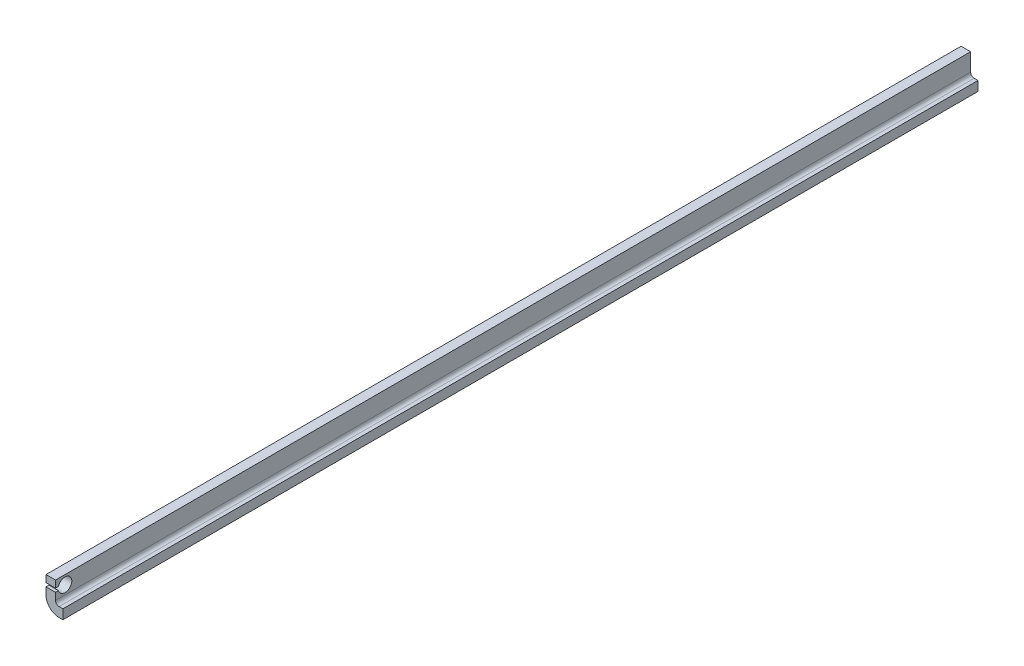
ISO-10303-21;
HEADER;
FILE_DESCRIPTION(('STEP AP214'),'2;1');
FILE_NAME('part.step','',(''),(''),'','','');
FILE_SCHEMA(('AUTOMOTIVE_DESIGN { 1 0 10303 214 1 1 1 1 }'));
ENDSEC;
DATA;
#1=APPLICATION_CONTEXT('core data for automotive mechanical design processes');
#2=APPLICATION_PROTOCOL_DEFINITION('international standard','automotive_design',2000,#1);
#3=PRODUCT_CONTEXT('',#1,'mechanical');
#4=PRODUCT('Part','Part','',(#3));
#5=PRODUCT_RELATED_PRODUCT_CATEGORY('part','',(#4));
#6=PRODUCT_DEFINITION_FORMATION('','',#4);
#7=PRODUCT_DEFINITION_CONTEXT('part definition',#1,'design');
#8=PRODUCT_DEFINITION('design','',#6,#7);
#9=PRODUCT_DEFINITION_SHAPE('','',#8);
#10=(LENGTH_UNIT() NAMED_UNIT(*) SI_UNIT(.MILLI.,.METRE.));
#11=(NAMED_UNIT(*) PLANE_ANGLE_UNIT() SI_UNIT($,.RADIAN.));
#12=(NAMED_UNIT(*) SI_UNIT($,.STERADIAN.) SOLID_ANGLE_UNIT());
#13=UNCERTAINTY_MEASURE_WITH_UNIT(LENGTH_MEASURE(1.E-05),#10,'distance_accuracy_value','');
#14=(GEOMETRIC_REPRESENTATION_CONTEXT(3) GLOBAL_UNCERTAINTY_ASSIGNED_CONTEXT((#13)) GLOBAL_UNIT_ASSIGNED_CONTEXT((#10,
#11,#12)) REPRESENTATION_CONTEXT('',''));
#15=CARTESIAN_POINT('',(0.,0.,0.));
#16=DIRECTION('',(0.,0.,1.));
#17=DIRECTION('',(1.,0.,0.));
#18=AXIS2_PLACEMENT_3D('',#15,#16,#17);
#19=CARTESIAN_POINT('',(11.8291924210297,-3.25477846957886,101.12425));
#20=DIRECTION('',(0.,0.,1.));
#21=DIRECTION('',(1.,0.,0.));
#22=AXIS2_PLACEMENT_3D('',#19,#20,#21);
#23=PLANE('',#22);
#24=DIRECTION('',(-1.,0.,0.));
#25=VECTOR('',#24,1.);
#26=CARTESIAN_POINT('',(11.8291924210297,-5.89787296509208,101.12425));
#27=LINE('',#26,#25);
#28=CARTESIAN_POINT('',(-1.08834656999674,-5.89787296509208,101.12425));
#29=VERTEX_POINT('',#28);
#30=CARTESIAN_POINT('',(-2.14166858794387,-5.89787296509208,101.12425));
#31=VERTEX_POINT('',#30);
#32=EDGE_CURVE('E11',#29,#31,#27,.T.);
#33=ORIENTED_EDGE('',*,*,#32,.F.);
#34=DIRECTION('',(0.,1.,0.));
#35=VECTOR('',#34,1.);
#36=CARTESIAN_POINT('',(-1.08834656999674,-7.07415346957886,101.12425));
#37=LINE('',#36,#35);
#38=CARTESIAN_POINT('',(-1.08834656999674,-5.12159246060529,101.12425));
#39=VERTEX_POINT('',#38);
#40=EDGE_CURVE('E200',#29,#39,#37,.T.);
#41=ORIENTED_EDGE('',*,*,#40,.T.);
#42=DIRECTION('',(-1.,0.,0.));
#43=VECTOR('',#42,1.);
#44=CARTESIAN_POINT('',(-1.08834656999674,-5.12159246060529,101.12425));
#45=LINE('',#44,#43);
#46=CARTESIAN_POINT('',(-2.14166858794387,-5.12159246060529,101.12425));
#47=VERTEX_POINT('',#46);
#48=EDGE_CURVE('E194',#39,#47,#45,.T.);
#49=ORIENTED_EDGE('',*,*,#48,.T.);
#50=DIRECTION('',(0.,-1.,0.));
#51=VECTOR('',#50,1.);
#52=CARTESIAN_POINT('',(-2.14166858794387,-5.12159246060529,101.12425));
#53=LINE('',#52,#51);
#54=EDGE_CURVE('E191',#47,#31,#53,.T.);
#55=ORIENTED_EDGE('',*,*,#54,.T.);
#56=EDGE_LOOP('',(#33,#41,#49,#55));
#57=FACE_BOUND('',#56,.T.);
#58=ADVANCED_FACE('F29',(#57),#23,.T.);
#59=CARTESIAN_POINT('',(-1.08834656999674,-7.07415346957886,105.000050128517));
#60=DIRECTION('',(-1.,0.,0.));
#61=DIRECTION('',(0.,-1.,0.));
#62=AXIS2_PLACEMENT_3D('',#59,#60,#61);
#63=PLANE('',#62);
#64=ORIENTED_EDGE('',*,*,#40,.F.);
#65=DIRECTION('',(0.,0.,-1.));
#66=VECTOR('',#65,1.);
#67=CARTESIAN_POINT('',(-1.08834656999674,-5.89787296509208,105.000050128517));
#68=LINE('',#67,#66);
#69=CARTESIAN_POINT('',(-1.08834656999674,-5.89787296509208,100.79709161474));
#70=VERTEX_POINT('',#69);
#71=EDGE_CURVE('E143',#29,#70,#68,.T.);
#72=ORIENTED_EDGE('',*,*,#71,.T.);
#73=CARTESIAN_POINT('',(-1.08834656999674,-6.09787296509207,100.07425));
#74=DIRECTION('',(-1.,0.,0.));
#75=DIRECTION('',(0.,-1.,0.));
#76=AXIS2_PLACEMENT_3D('',#73,#74,#75);
#77=CIRCLE('',#76,0.750000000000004);
#78=CARTESIAN_POINT('',(-1.08834656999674,-6.29787296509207,100.79709161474));
#79=VERTEX_POINT('',#78);
#80=EDGE_CURVE('E146',#70,#79,#77,.T.);
#81=ORIENTED_EDGE('',*,*,#80,.T.);
#82=DIRECTION('',(0.,0.,1.));
#83=VECTOR('',#82,1.);
#84=CARTESIAN_POINT('',(-1.08834656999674,-6.29787296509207,105.000050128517));
#85=LINE('',#84,#83);
#86=CARTESIAN_POINT('',(-1.08834656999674,-6.29787296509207,101.12425));
#87=VERTEX_POINT('',#86);
#88=EDGE_CURVE('E120',#79,#87,#85,.T.);
#89=ORIENTED_EDGE('',*,*,#88,.T.);
#90=CARTESIAN_POINT('',(-1.08834656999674,-7.07415346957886,101.12425));
#91=VERTEX_POINT('',#90);
#92=EDGE_CURVE('E197',#91,#87,#37,.T.);
#93=ORIENTED_EDGE('',*,*,#92,.F.);
#94=DIRECTION('',(0.,0.,-1.));
#95=VECTOR('',#94,1.);
#96=CARTESIAN_POINT('',(-1.08834656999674,-7.07415346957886,105.000050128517));
#97=LINE('',#96,#95);
#98=CARTESIAN_POINT('',(-1.08834656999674,-7.07415346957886,0.));
#99=VERTEX_POINT('',#98);
#100=EDGE_CURVE('E52',#91,#99,#97,.T.);
#101=ORIENTED_EDGE('',*,*,#100,.T.);
#102=DIRECTION('',(0.,1.,0.));
#103=VECTOR('',#102,1.);
#104=CARTESIAN_POINT('',(-1.08834656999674,-7.07415346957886,0.));
#105=LINE('',#104,#103);
#106=CARTESIAN_POINT('',(-1.08834656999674,-5.12159246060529,0.));
#107=VERTEX_POINT('',#106);
#108=EDGE_CURVE('E176',#99,#107,#105,.T.);
#109=ORIENTED_EDGE('',*,*,#108,.T.);
#110=DIRECTION('',(0.,0.,-1.));
#111=VECTOR('',#110,1.);
#112=CARTESIAN_POINT('',(-1.08834656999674,-5.12159246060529,105.000050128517));
#113=LINE('',#112,#111);
#114=EDGE_CURVE('E175',#39,#107,#113,.T.);
#115=ORIENTED_EDGE('',*,*,#114,.F.);
#116=EDGE_LOOP('',(#64,#72,#81,#89,#93,#101,#109,#115));
#117=FACE_BOUND('',#116,.T.);
#118=ADVANCED_FACE('F213',(#117),#63,.F.);
#119=CARTESIAN_POINT('',(-1.08834656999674,-5.12159246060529,105.000050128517));
#120=DIRECTION('',(0.,-1.,0.));
#121=DIRECTION('',(0.,0.,-1.));
#122=AXIS2_PLACEMENT_3D('',#119,#120,#121);
#123=PLANE('',#122);
#124=ORIENTED_EDGE('',*,*,#48,.F.);
#125=ORIENTED_EDGE('',*,*,#114,.T.);
#126=DIRECTION('',(-1.,0.,0.));
#127=VECTOR('',#126,1.);
#128=CARTESIAN_POINT('',(-1.08834656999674,-5.12159246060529,0.));
#129=LINE('',#128,#127);
#130=CARTESIAN_POINT('',(-2.14166858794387,-5.12159246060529,0.));
#131=VERTEX_POINT('',#130);
#132=EDGE_CURVE('E172',#107,#131,#129,.T.);
#133=ORIENTED_EDGE('',*,*,#132,.T.);
#134=DIRECTION('',(0.,0.,-1.));
#135=VECTOR('',#134,1.);
#136=CARTESIAN_POINT('',(-2.14166858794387,-5.12159246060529,105.000050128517));
#137=LINE('',#136,#135);
#138=EDGE_CURVE('E171',#47,#131,#137,.T.);
#139=ORIENTED_EDGE('',*,*,#138,.F.);
#140=EDGE_LOOP('',(#124,#125,#133,#139));
#141=FACE_BOUND('',#140,.T.);
#142=ADVANCED_FACE('F229',(#141),#123,.F.);
#143=CARTESIAN_POINT('',(-2.14166858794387,-5.12159246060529,105.000050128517));
#144=DIRECTION('',(1.,0.,0.));
#145=DIRECTION('',(0.,1.,0.));
#146=AXIS2_PLACEMENT_3D('',#143,#144,#145);
#147=PLANE('',#146);
#148=CARTESIAN_POINT('',(-2.14166858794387,-6.09787296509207,100.07425));
#149=DIRECTION('',(-1.,0.,0.));
#150=DIRECTION('',(0.,0.,1.));
#151=AXIS2_PLACEMENT_3D('',#148,#149,#150);
#152=CIRCLE('',#151,0.750000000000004);
#153=CARTESIAN_POINT('',(-2.14166858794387,-5.89787296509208,100.79709161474));
#154=VERTEX_POINT('',#153);
#155=CARTESIAN_POINT('',(-2.14166858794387,-6.29787296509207,100.79709161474));
#156=VERTEX_POINT('',#155);
#157=EDGE_CURVE('E127',#154,#156,#152,.T.);
#158=ORIENTED_EDGE('',*,*,#157,.F.);
#159=DIRECTION('',(0.,0.,-1.));
#160=VECTOR('',#159,1.);
#161=CARTESIAN_POINT('',(-2.14166858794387,-5.89787296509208,100.79709161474));
#162=LINE('',#161,#160);
#163=EDGE_CURVE('E124',#31,#154,#162,.T.);
#164=ORIENTED_EDGE('',*,*,#163,.F.);
#165=ORIENTED_EDGE('',*,*,#54,.F.);
#166=ORIENTED_EDGE('',*,*,#138,.T.);
#167=DIRECTION('',(0.,-1.,0.));
#168=VECTOR('',#167,1.);
#169=CARTESIAN_POINT('',(-2.14166858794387,-5.12159246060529,0.));
#170=LINE('',#169,#168);
#171=CARTESIAN_POINT('',(-2.14166858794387,-7.07415346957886,0.));
#172=VERTEX_POINT('',#171);
#173=EDGE_CURVE('E168',#131,#172,#170,.T.);
#174=ORIENTED_EDGE('',*,*,#173,.T.);
#175=DIRECTION('',(0.,0.,-1.));
#176=VECTOR('',#175,1.);
#177=CARTESIAN_POINT('',(-2.14166858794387,-7.07415346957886,105.000050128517));
#178=LINE('',#177,#176);
#179=CARTESIAN_POINT('',(-2.14166858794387,-7.07415346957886,101.12425));
#180=VERTEX_POINT('',#179);
#181=EDGE_CURVE('E167',#180,#172,#178,.T.);
#182=ORIENTED_EDGE('',*,*,#181,.F.);
#183=CARTESIAN_POINT('',(-2.14166858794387,-6.29787296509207,101.12425));
#184=VERTEX_POINT('',#183);
#185=EDGE_CURVE('E137',#184,#180,#53,.T.);
#186=ORIENTED_EDGE('',*,*,#185,.F.);
#187=DIRECTION('',(0.,0.,1.));
#188=VECTOR('',#187,1.);
#189=CARTESIAN_POINT('',(-2.14166858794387,-6.29787296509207,100.79709161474));
#190=LINE('',#189,#188);
#191=EDGE_CURVE('E44',#156,#184,#190,.T.);
#192=ORIENTED_EDGE('',*,*,#191,.F.);
#193=EDGE_LOOP('',(#158,#164,#165,#166,#174,#182,#186,#192));
#194=FACE_BOUND('',#193,.T.);
#195=ADVANCED_FACE('F135',(#194),#147,.F.);
#196=CARTESIAN_POINT('',(-0.698357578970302,-7.07415346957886,105.000050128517));
#197=DIRECTION('',(0.,0.,-1.));
#198=DIRECTION('',(-1.,0.,0.));
#199=AXIS2_PLACEMENT_3D('',#196,#197,#198);
#200=CYLINDRICAL_SURFACE('',#199,1.44331100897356);
#201=CARTESIAN_POINT('',(-0.698357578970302,-7.07415346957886,101.12425));
#202=DIRECTION('',(0.,0.,1.));
#203=DIRECTION('',(1.,0.,0.));
#204=AXIS2_PLACEMENT_3D('',#201,#202,#203);
#205=CIRCLE('',#204,1.44331100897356);
#206=CARTESIAN_POINT('',(-0.698357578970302,-8.51746447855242,101.12425));
#207=VERTEX_POINT('',#206);
#208=EDGE_CURVE('E188',#180,#207,#205,.T.);
#209=ORIENTED_EDGE('',*,*,#208,.F.);
#210=ORIENTED_EDGE('',*,*,#181,.T.);
#211=CARTESIAN_POINT('',(-0.698357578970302,-7.07415346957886,0.));
#212=DIRECTION('',(0.,0.,1.));
#213=DIRECTION('',(1.,0.,0.));
#214=AXIS2_PLACEMENT_3D('',#211,#212,#213);
#215=CIRCLE('',#214,1.44331100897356);
#216=CARTESIAN_POINT('',(-0.698357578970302,-8.51746447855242,0.));
#217=VERTEX_POINT('',#216);
#218=EDGE_CURVE('E164',#172,#217,#215,.T.);
#219=ORIENTED_EDGE('',*,*,#218,.T.);
#220=DIRECTION('',(0.,0.,-1.));
#221=VECTOR('',#220,1.);
#222=CARTESIAN_POINT('',(-0.698357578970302,-8.51746447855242,105.000050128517));
#223=LINE('',#222,#221);
#224=EDGE_CURVE('E163',#207,#217,#223,.T.);
#225=ORIENTED_EDGE('',*,*,#224,.F.);
#226=EDGE_LOOP('',(#209,#210,#219,#225));
#227=FACE_BOUND('',#226,.T.);
#228=ADVANCED_FACE('F240',(#227),#200,.T.);
#229=CARTESIAN_POINT('',(-0.698357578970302,-8.51746447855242,105.000050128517));
#230=DIRECTION('',(0.,1.,0.));
#231=DIRECTION('',(0.,0.,1.));
#232=AXIS2_PLACEMENT_3D('',#229,#230,#231);
#233=PLANE('',#232);
#234=DIRECTION('',(1.,0.,0.));
#235=VECTOR('',#234,1.);
#236=CARTESIAN_POINT('',(-0.698357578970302,-8.51746447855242,101.12425));
#237=LINE('',#236,#235);
#238=CARTESIAN_POINT('',(-0.273546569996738,-8.51746447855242,101.12425));
#239=VERTEX_POINT('',#238);
#240=EDGE_CURVE('E185',#207,#239,#237,.T.);
#241=ORIENTED_EDGE('',*,*,#240,.F.);
#242=ORIENTED_EDGE('',*,*,#224,.T.);
#243=DIRECTION('',(1.,0.,0.));
#244=VECTOR('',#243,1.);
#245=CARTESIAN_POINT('',(-0.698357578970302,-8.51746447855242,0.));
#246=LINE('',#245,#244);
#247=CARTESIAN_POINT('',(-0.273546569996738,-8.51746447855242,0.));
#248=VERTEX_POINT('',#247);
#249=EDGE_CURVE('E160',#217,#248,#246,.T.);
#250=ORIENTED_EDGE('',*,*,#249,.T.);
#251=DIRECTION('',(0.,0.,-1.));
#252=VECTOR('',#251,1.);
#253=CARTESIAN_POINT('',(-0.273546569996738,-8.51746447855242,105.000050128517));
#254=LINE('',#253,#252);
#255=EDGE_CURVE('E159',#239,#248,#254,.T.);
#256=ORIENTED_EDGE('',*,*,#255,.F.);
#257=EDGE_LOOP('',(#241,#242,#250,#256));
#258=FACE_BOUND('',#257,.T.);
#259=ADVANCED_FACE('F243',(#258),#233,.F.);
#260=CARTESIAN_POINT('',(-0.273546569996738,-8.51746447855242,105.000050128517));
#261=DIRECTION('',(-1.,0.,0.));
#262=DIRECTION('',(0.,-1.,0.));
#263=AXIS2_PLACEMENT_3D('',#260,#261,#262);
#264=PLANE('',#263);
#265=DIRECTION('',(0.,1.,0.));
#266=VECTOR('',#265,1.);
#267=CARTESIAN_POINT('',(-0.273546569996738,-8.51746447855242,101.12425));
#268=LINE('',#267,#266);
#269=CARTESIAN_POINT('',(-0.273546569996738,-7.46414246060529,101.12425));
#270=VERTEX_POINT('',#269);
#271=EDGE_CURVE('E182',#239,#270,#268,.T.);
#272=ORIENTED_EDGE('',*,*,#271,.F.);
#273=ORIENTED_EDGE('',*,*,#255,.T.);
#274=DIRECTION('',(0.,1.,0.));
#275=VECTOR('',#274,1.);
#276=CARTESIAN_POINT('',(-0.273546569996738,-8.51746447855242,0.));
#277=LINE('',#276,#275);
#278=CARTESIAN_POINT('',(-0.273546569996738,-7.46414246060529,0.));
#279=VERTEX_POINT('',#278);
#280=EDGE_CURVE('E156',#248,#279,#277,.T.);
#281=ORIENTED_EDGE('',*,*,#280,.T.);
#282=DIRECTION('',(0.,0.,-1.));
#283=VECTOR('',#282,1.);
#284=CARTESIAN_POINT('',(-0.273546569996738,-7.46414246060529,105.000050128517));
#285=LINE('',#284,#283);
#286=EDGE_CURVE('E155',#270,#279,#285,.T.);
#287=ORIENTED_EDGE('',*,*,#286,.F.);
#288=EDGE_LOOP('',(#272,#273,#281,#287));
#289=FACE_BOUND('',#288,.T.);
#290=ADVANCED_FACE('F245',(#289),#264,.F.);
#291=CARTESIAN_POINT('',(-0.273546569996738,-7.46414246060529,105.000050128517));
#292=DIRECTION('',(0.,-1.,0.));
#293=DIRECTION('',(1.,0.,0.));
#294=AXIS2_PLACEMENT_3D('',#291,#292,#293);
#295=PLANE('',#294);
#296=DIRECTION('',(-1.,0.,0.));
#297=VECTOR('',#296,1.);
#298=CARTESIAN_POINT('',(-0.273546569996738,-7.46414246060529,101.12425));
#299=LINE('',#298,#297);
#300=CARTESIAN_POINT('',(-0.698357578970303,-7.46414246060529,101.12425));
#301=VERTEX_POINT('',#300);
#302=EDGE_CURVE('E179',#270,#301,#299,.T.);
#303=ORIENTED_EDGE('',*,*,#302,.F.);
#304=ORIENTED_EDGE('',*,*,#286,.T.);
#305=DIRECTION('',(-1.,0.,0.));
#306=VECTOR('',#305,1.);
#307=CARTESIAN_POINT('',(-0.273546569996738,-7.46414246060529,0.));
#308=LINE('',#307,#306);
#309=CARTESIAN_POINT('',(-0.698357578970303,-7.46414246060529,0.));
#310=VERTEX_POINT('',#309);
#311=EDGE_CURVE('E152',#279,#310,#308,.T.);
#312=ORIENTED_EDGE('',*,*,#311,.T.);
#313=DIRECTION('',(0.,0.,-1.));
#314=VECTOR('',#313,1.);
#315=CARTESIAN_POINT('',(-0.698357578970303,-7.46414246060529,105.000050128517));
#316=LINE('',#315,#314);
#317=EDGE_CURVE('E151',#301,#310,#316,.T.);
#318=ORIENTED_EDGE('',*,*,#317,.F.);
#319=EDGE_LOOP('',(#303,#304,#312,#318));
#320=FACE_BOUND('',#319,.T.);
#321=ADVANCED_FACE('F219',(#320),#295,.F.);
#322=CARTESIAN_POINT('',(-0.698357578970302,-7.07415346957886,105.000050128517));
#323=DIRECTION('',(0.,0.,-1.));
#324=DIRECTION('',(-1.,0.,0.));
#325=AXIS2_PLACEMENT_3D('',#322,#323,#324);
#326=CYLINDRICAL_SURFACE('',#325,0.389988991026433);
#327=CARTESIAN_POINT('',(-0.698357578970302,-7.07415346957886,101.12425));
#328=DIRECTION('',(0.,0.,1.));
#329=DIRECTION('',(1.,0.,0.));
#330=AXIS2_PLACEMENT_3D('',#327,#328,#329);
#331=CIRCLE('',#330,0.389988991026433);
#332=EDGE_CURVE('E150',#301,#91,#331,.F.);
#333=ORIENTED_EDGE('',*,*,#332,.F.);
#334=ORIENTED_EDGE('',*,*,#317,.T.);
#335=CARTESIAN_POINT('',(-0.698357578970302,-7.07415346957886,0.));
#336=DIRECTION('',(0.,0.,-1.));
#337=DIRECTION('',(1.,0.,0.));
#338=AXIS2_PLACEMENT_3D('',#335,#336,#337);
#339=CIRCLE('',#338,0.389988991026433);
#340=EDGE_CURVE('E148',#310,#99,#339,.T.);
#341=ORIENTED_EDGE('',*,*,#340,.T.);
#342=ORIENTED_EDGE('',*,*,#100,.F.);
#343=EDGE_LOOP('',(#333,#334,#341,#342));
#344=FACE_BOUND('',#343,.T.);
#345=ADVANCED_FACE('F214',(#344),#326,.F.);
#346=CARTESIAN_POINT('',(-0.698357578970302,-7.07415346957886,0.));
#347=DIRECTION('',(0.,0.,1.));
#348=DIRECTION('',(1.,0.,0.));
#349=AXIS2_PLACEMENT_3D('',#346,#347,#348);
#350=PLANE('',#349);
#351=ORIENTED_EDGE('',*,*,#108,.F.);
#352=ORIENTED_EDGE('',*,*,#340,.F.);
#353=ORIENTED_EDGE('',*,*,#311,.F.);
#354=ORIENTED_EDGE('',*,*,#280,.F.);
#355=ORIENTED_EDGE('',*,*,#249,.F.);
#356=ORIENTED_EDGE('',*,*,#218,.F.);
#357=ORIENTED_EDGE('',*,*,#173,.F.);
#358=ORIENTED_EDGE('',*,*,#132,.F.);
#359=EDGE_LOOP('',(#351,#352,#353,#354,#355,#356,#357,#358));
#360=FACE_BOUND('',#359,.T.);
#361=ADVANCED_FACE('F223',(#360),#350,.F.);
#362=DIRECTION('',(1.,0.,0.));
#363=VECTOR('',#362,1.);
#364=CARTESIAN_POINT('',(11.8291924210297,-6.29787296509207,101.12425));
#365=LINE('',#364,#363);
#366=EDGE_CURVE('E37',#184,#87,#365,.T.);
#367=ORIENTED_EDGE('',*,*,#366,.F.);
#368=ORIENTED_EDGE('',*,*,#185,.T.);
#369=ORIENTED_EDGE('',*,*,#208,.T.);
#370=ORIENTED_EDGE('',*,*,#240,.T.);
#371=ORIENTED_EDGE('',*,*,#271,.T.);
#372=ORIENTED_EDGE('',*,*,#302,.T.);
#373=ORIENTED_EDGE('',*,*,#332,.T.);
#374=ORIENTED_EDGE('',*,*,#92,.T.);
#375=EDGE_LOOP('',(#367,#368,#369,#370,#371,#372,#373,#374));
#376=FACE_BOUND('',#375,.T.);
#377=ADVANCED_FACE('F31',(#376),#23,.T.);
#378=CARTESIAN_POINT('',(-0.273546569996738,-6.09787296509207,100.07425));
#379=DIRECTION('',(-1.,0.,0.));
#380=DIRECTION('',(0.,0.,1.));
#381=AXIS2_PLACEMENT_3D('',#378,#379,#380);
#382=CYLINDRICAL_SURFACE('',#381,0.750000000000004);
#383=DIRECTION('',(-1.,0.,0.));
#384=VECTOR('',#383,1.);
#385=CARTESIAN_POINT('',(-0.273546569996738,-5.89787296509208,100.79709161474));
#386=LINE('',#385,#384);
#387=EDGE_CURVE('E123',#70,#154,#386,.T.);
#388=ORIENTED_EDGE('',*,*,#387,.T.);
#389=ORIENTED_EDGE('',*,*,#157,.T.);
#390=DIRECTION('',(-1.,0.,0.));
#391=VECTOR('',#390,1.);
#392=CARTESIAN_POINT('',(-0.273546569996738,-6.29787296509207,100.79709161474));
#393=LINE('',#392,#391);
#394=EDGE_CURVE('E116',#79,#156,#393,.T.);
#395=ORIENTED_EDGE('',*,*,#394,.F.);
#396=ORIENTED_EDGE('',*,*,#80,.F.);
#397=EDGE_LOOP('',(#388,#389,#395,#396));
#398=FACE_BOUND('',#397,.T.);
#399=ADVANCED_FACE('F128',(#398),#382,.F.);
#400=CARTESIAN_POINT('',(-0.273546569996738,-5.89787296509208,100.79709161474));
#401=DIRECTION('',(0.,1.,0.));
#402=DIRECTION('',(0.,0.,1.));
#403=AXIS2_PLACEMENT_3D('',#400,#401,#402);
#404=PLANE('',#403);
#405=ORIENTED_EDGE('',*,*,#32,.T.);
#406=ORIENTED_EDGE('',*,*,#163,.T.);
#407=ORIENTED_EDGE('',*,*,#387,.F.);
#408=ORIENTED_EDGE('',*,*,#71,.F.);
#409=EDGE_LOOP('',(#405,#406,#407,#408));
#410=FACE_BOUND('',#409,.T.);
#411=ADVANCED_FACE('F234',(#410),#404,.F.);
#412=CARTESIAN_POINT('',(-0.273546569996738,-6.29787296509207,100.79709161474));
#413=DIRECTION('',(0.,-1.,0.));
#414=DIRECTION('',(0.,0.,-1.));
#415=AXIS2_PLACEMENT_3D('',#412,#413,#414);
#416=PLANE('',#415);
#417=ORIENTED_EDGE('',*,*,#394,.T.);
#418=ORIENTED_EDGE('',*,*,#191,.T.);
#419=ORIENTED_EDGE('',*,*,#366,.T.);
#420=ORIENTED_EDGE('',*,*,#88,.F.);
#421=EDGE_LOOP('',(#417,#418,#419,#420));
#422=FACE_BOUND('',#421,.T.);
#423=ADVANCED_FACE('F118',(#422),#416,.F.);
#424=CLOSED_SHELL('',(#58,#118,#142,#195,#228,#259,#290,#321,#345,#361,#377,#399,#411,#423));
#425=MANIFOLD_SOLID_BREP('B2',#424);
#426=ADVANCED_BREP_SHAPE_REPRESENTATION('',(#18,#425),#14);
#427=SHAPE_DEFINITION_REPRESENTATION(#9,#426);
ENDSEC;
END-ISO-10303-21;
